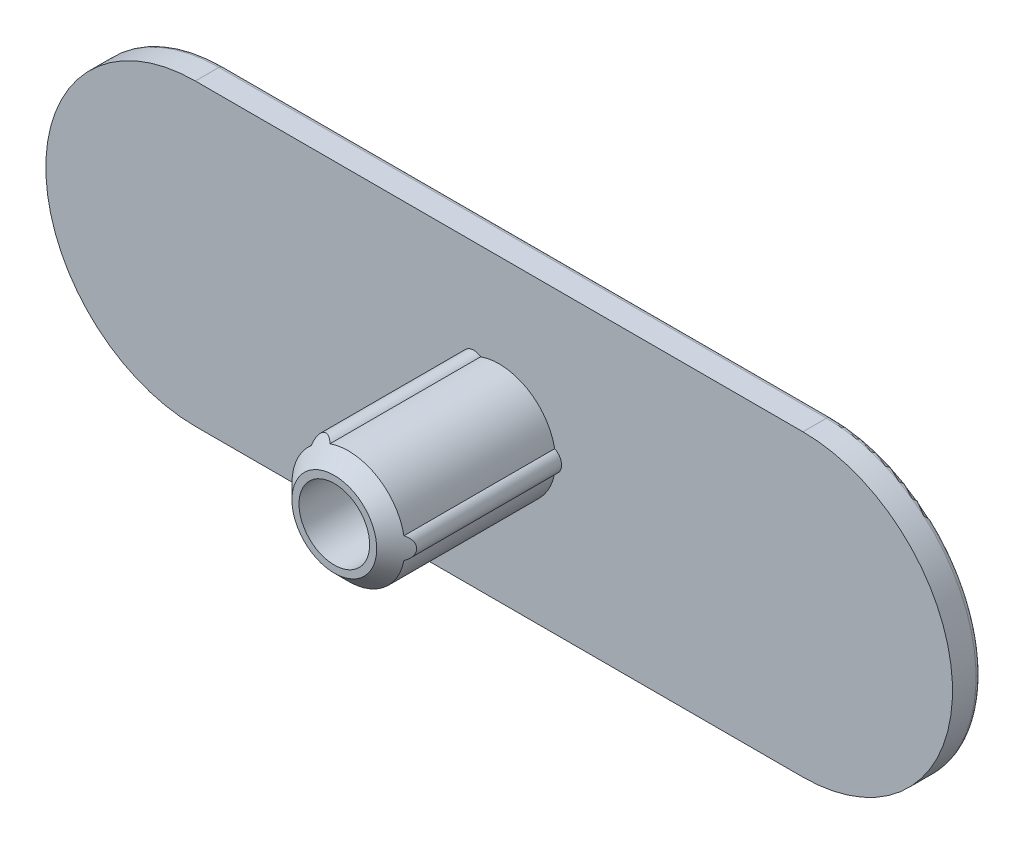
ISO-10303-21;
HEADER;
FILE_DESCRIPTION(('STEP AP214'),'2;1');
FILE_NAME('part.step','',(''),(''),'','','');
FILE_SCHEMA(('AUTOMOTIVE_DESIGN { 1 0 10303 214 1 1 1 1 }'));
ENDSEC;
DATA;
#1=APPLICATION_CONTEXT('core data for automotive mechanical design processes');
#2=APPLICATION_PROTOCOL_DEFINITION('international standard','automotive_design',2000,#1);
#3=PRODUCT_CONTEXT('',#1,'mechanical');
#4=PRODUCT('Part','Part','',(#3));
#5=PRODUCT_RELATED_PRODUCT_CATEGORY('part','',(#4));
#6=PRODUCT_DEFINITION_FORMATION('','',#4);
#7=PRODUCT_DEFINITION_CONTEXT('part definition',#1,'design');
#8=PRODUCT_DEFINITION('design','',#6,#7);
#9=PRODUCT_DEFINITION_SHAPE('','',#8);
#10=(LENGTH_UNIT() NAMED_UNIT(*) SI_UNIT(.MILLI.,.METRE.));
#11=(NAMED_UNIT(*) PLANE_ANGLE_UNIT() SI_UNIT($,.RADIAN.));
#12=(NAMED_UNIT(*) SI_UNIT($,.STERADIAN.) SOLID_ANGLE_UNIT());
#13=UNCERTAINTY_MEASURE_WITH_UNIT(LENGTH_MEASURE(1.E-05),#10,'distance_accuracy_value','');
#14=(GEOMETRIC_REPRESENTATION_CONTEXT(3) GLOBAL_UNCERTAINTY_ASSIGNED_CONTEXT((#13)) GLOBAL_UNIT_ASSIGNED_CONTEXT((#10,
#11,#12)) REPRESENTATION_CONTEXT('',''));
#15=CARTESIAN_POINT('',(0.,0.,0.));
#16=DIRECTION('',(0.,0.,1.));
#17=DIRECTION('',(1.,0.,0.));
#18=AXIS2_PLACEMENT_3D('',#15,#16,#17);
#19=CARTESIAN_POINT('',(0.,0.,1.1));
#20=DIRECTION('',(0.,0.,-1.));
#21=DIRECTION('',(-1.,0.,0.));
#22=AXIS2_PLACEMENT_3D('',#19,#20,#21);
#23=PLANE('',#22);
#24=CARTESIAN_POINT('',(0.,0.,1.1));
#25=DIRECTION('',(0.,0.,-1.));
#26=DIRECTION('',(0.,1.,0.));
#27=AXIS2_PLACEMENT_3D('',#24,#25,#26);
#28=CIRCLE('',#27,1.5);
#29=CARTESIAN_POINT('',(0.,1.5,1.1));
#30=VERTEX_POINT('',#29);
#31=EDGE_CURVE('E19',#30,#30,#28,.F.);
#32=ORIENTED_EDGE('',*,*,#31,.T.);
#33=EDGE_LOOP('',(#32));
#34=FACE_BOUND('',#33,.T.);
#35=ADVANCED_FACE('F16',(#34),#23,.F.);
#36=CARTESIAN_POINT('',(0.,0.,7.6));
#37=DIRECTION('',(0.,0.,-1.));
#38=DIRECTION('',(0.,1.,0.));
#39=AXIS2_PLACEMENT_3D('',#36,#37,#38);
#40=CYLINDRICAL_SURFACE('',#39,1.5);
#41=CARTESIAN_POINT('',(0.,0.,7.6));
#42=DIRECTION('',(0.,0.,-1.));
#43=DIRECTION('',(0.,1.,0.));
#44=AXIS2_PLACEMENT_3D('',#41,#42,#43);
#45=CIRCLE('',#44,1.5);
#46=CARTESIAN_POINT('',(0.,1.5,7.6));
#47=VERTEX_POINT('',#46);
#48=EDGE_CURVE('E113',#47,#47,#45,.T.);
#49=ORIENTED_EDGE('',*,*,#48,.F.);
#50=EDGE_LOOP('',(#49));
#51=FACE_BOUND('',#50,.T.);
#52=ORIENTED_EDGE('',*,*,#31,.F.);
#53=EDGE_LOOP('',(#52));
#54=FACE_BOUND('',#53,.T.);
#55=ADVANCED_FACE('F182',(#51,#54),#40,.F.);
#56=CARTESIAN_POINT('',(0.,0.,7.6));
#57=DIRECTION('',(0.,0.,1.));
#58=DIRECTION('',(1.,0.,0.));
#59=AXIS2_PLACEMENT_3D('',#56,#57,#58);
#60=PLANE('',#59);
#61=ORIENTED_EDGE('',*,*,#48,.T.);
#62=EDGE_LOOP('',(#61));
#63=FACE_BOUND('',#62,.T.);
#64=CARTESIAN_POINT('',(0.,0.,7.60000000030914));
#65=DIRECTION('',(0.,0.,-1.));
#66=DIRECTION('',(0.,1.,0.));
#67=AXIS2_PLACEMENT_3D('',#64,#65,#66);
#68=CIRCLE('',#67,1.80000000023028);
#69=CARTESIAN_POINT('',(0.,1.80000000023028,7.60000000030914));
#70=VERTEX_POINT('',#69);
#71=EDGE_CURVE('E174',#70,#70,#68,.T.);
#72=ORIENTED_EDGE('',*,*,#71,.F.);
#73=EDGE_LOOP('',(#72));
#74=FACE_BOUND('',#73,.T.);
#75=ADVANCED_FACE('F184',(#63,#74),#60,.T.);
#76=CARTESIAN_POINT('',(-1.075,1.86195461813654,0.6));
#77=DIRECTION('',(0.,0.,1.));
#78=DIRECTION('',(1.,0.,0.));
#79=AXIS2_PLACEMENT_3D('',#76,#77,#78);
#80=CYLINDRICAL_SURFACE('',#79,0.5);
#81=CARTESIAN_POINT('',(-1.075,1.86195461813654,0.6));
#82=DIRECTION('',(0.,0.,1.));
#83=DIRECTION('',(1.,0.,0.));
#84=AXIS2_PLACEMENT_3D('',#81,#82,#83);
#85=CIRCLE('',#84,0.5);
#86=CARTESIAN_POINT('',(-0.783798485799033,2.2684047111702,0.6));
#87=VERTEX_POINT('',#86);
#88=CARTESIAN_POINT('',(-1.57259686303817,1.81299175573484,0.6));
#89=VERTEX_POINT('',#88);
#90=EDGE_CURVE('E102',#87,#89,#85,.T.);
#91=ORIENTED_EDGE('',*,*,#90,.T.);
#92=DIRECTION('',(0.,0.,1.));
#93=VECTOR('',#92,1.);
#94=CARTESIAN_POINT('',(-1.57259686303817,1.81299175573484,0.6));
#95=LINE('',#94,#93);
#96=CARTESIAN_POINT('',(-1.57259686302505,1.81299175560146,6.99999999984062));
#97=VERTEX_POINT('',#96);
#98=EDGE_CURVE('E108',#97,#89,#95,.F.);
#99=ORIENTED_EDGE('',*,*,#98,.F.);
#100=CARTESIAN_POINT('',(-0.783798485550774,2.26840471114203,6.99999999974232));
#101=CARTESIAN_POINT('',(-0.810386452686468,2.28747811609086,6.97326995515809));
#102=CARTESIAN_POINT('',(-0.839755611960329,2.30452835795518,6.94735774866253));
#103=CARTESIAN_POINT('',(-0.903591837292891,2.33296381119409,6.89829129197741));
#104=CARTESIAN_POINT('',(-0.938102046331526,2.34429712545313,6.87516370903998));
#105=CARTESIAN_POINT('',(-0.997817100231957,2.35652488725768,6.84100170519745));
#106=CARTESIAN_POINT('',(-1.02178258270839,2.35972475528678,6.82864604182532));
#107=CARTESIAN_POINT('',(-1.07088241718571,2.36253948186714,6.80617958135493));
#108=CARTESIAN_POINT('',(-1.09601279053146,2.3621657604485,6.7960617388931));
#109=CARTESIAN_POINT('',(-1.14711032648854,2.35739810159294,6.7784349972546));
#110=CARTESIAN_POINT('',(-1.17308327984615,2.35296475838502,6.77095266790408));
#111=CARTESIAN_POINT('',(-1.22467991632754,2.3397651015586,6.7592293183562));
#112=CARTESIAN_POINT('',(-1.25030373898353,2.33100057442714,6.75498696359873));
#113=CARTESIAN_POINT('',(-1.29661905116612,2.31076811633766,6.75041023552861));
#114=CARTESIAN_POINT('',(-1.31750297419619,2.29984076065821,6.74961703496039));
#115=CARTESIAN_POINT('',(-1.35746399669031,2.27519107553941,6.75072593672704));
#116=CARTESIAN_POINT('',(-1.37654186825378,2.26146994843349,6.75262688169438));
#117=CARTESIAN_POINT('',(-1.41115113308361,2.23273134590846,6.75879339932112));
#118=CARTESIAN_POINT('',(-1.42683327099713,2.21785853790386,6.76289518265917));
#119=CARTESIAN_POINT('',(-1.45585234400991,2.18661795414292,6.77314342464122));
#120=CARTESIAN_POINT('',(-1.46918907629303,2.17025004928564,6.77929005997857));
#121=CARTESIAN_POINT('',(-1.4942639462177,2.13529173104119,6.79388089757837));
#122=CARTESIAN_POINT('',(-1.50581861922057,2.11662611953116,6.8024583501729));
#123=CARTESIAN_POINT('',(-1.5261152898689,2.07865619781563,6.82134449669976));
#124=CARTESIAN_POINT('',(-1.53485502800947,2.0593513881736,6.83165457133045));
#125=CARTESIAN_POINT('',(-1.55297453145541,2.01177935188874,6.85867480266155));
#126=CARTESIAN_POINT('',(-1.56086921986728,1.98339209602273,6.87617589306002));
#127=CARTESIAN_POINT('',(-1.57156234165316,1.92714038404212,6.91339580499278));
#128=CARTESIAN_POINT('',(-1.57435438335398,1.89927662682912,6.93311737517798));
#129=CARTESIAN_POINT('',(-1.57529897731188,1.85197460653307,6.96870196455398));
#130=CARTESIAN_POINT('',(-1.57449063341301,1.83227189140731,6.9841905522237));
#131=CARTESIAN_POINT('',(-1.57259686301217,1.81299175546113,6.99999999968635));
#132=B_SPLINE_CURVE_WITH_KNOTS('',3,(#100,#101,#102,#103,#104,#105,#106,#107,#108,#109,#110,
#111,#112,#113,#114,#115,#116,#117,#118,#119,#120,#121,#122,#123,#124,#125,#126,#127,#128,#129,
#130,#131),.UNSPECIFIED.,.F.,.F.,(4,2,2,2,2,2,2,2,2,2,2,2,2,2,2,4),(0.,0.127138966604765,
0.255412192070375,0.336558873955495,0.41744632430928,0.499127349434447,0.580774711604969,
0.651145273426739,0.721485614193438,0.787198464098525,0.852916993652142,0.923352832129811,
0.993845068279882,1.09609091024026,1.19846473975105,1.27352419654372),.UNSPECIFIED.);
#133=CARTESIAN_POINT('',(-0.783798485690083,2.26840471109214,6.99999999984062));
#134=VERTEX_POINT('',#133);
#135=EDGE_CURVE('E112',#134,#97,#132,.T.);
#136=ORIENTED_EDGE('',*,*,#135,.F.);
#137=DIRECTION('',(0.,0.,1.));
#138=VECTOR('',#137,1.);
#139=CARTESIAN_POINT('',(-0.783798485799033,2.2684047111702,0.6));
#140=LINE('',#139,#138);
#141=EDGE_CURVE('E110',#87,#134,#140,.T.);
#142=ORIENTED_EDGE('',*,*,#141,.F.);
#143=EDGE_LOOP('',(#91,#99,#136,#142));
#144=FACE_BOUND('',#143,.T.);
#145=ADVANCED_FACE('F107',(#144),#80,.T.);
#146=CARTESIAN_POINT('',(0.,0.,6.74489409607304));
#147=DIRECTION('',(0.,0.,-1.));
#148=DIRECTION('',(0.,1.,0.));
#149=AXIS2_PLACEMENT_3D('',#146,#147,#148);
#150=CONICAL_SURFACE('',#149,2.65510590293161,0.785398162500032);
#151=ORIENTED_EDGE('',*,*,#71,.T.);
#152=EDGE_LOOP('',(#151));
#153=FACE_BOUND('',#152,.T.);
#154=CARTESIAN_POINT('',(0.,0.,7.));
#155=DIRECTION('',(0.,0.,1.));
#156=DIRECTION('',(1.,0.,0.));
#157=AXIS2_PLACEMENT_3D('',#154,#155,#156);
#158=CIRCLE('',#157,2.4);
#159=CARTESIAN_POINT('',(2.35639534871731,0.455412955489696,6.99999999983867));
#160=VERTEX_POINT('',#159);
#161=EDGE_CURVE('E327',#134,#160,#158,.F.);
#162=ORIENTED_EDGE('',*,*,#161,.F.);
#163=ORIENTED_EDGE('',*,*,#135,.T.);
#164=CARTESIAN_POINT('',(0.,0.,7.));
#165=DIRECTION('',(0.,0.,1.));
#166=DIRECTION('',(1.,0.,0.));
#167=AXIS2_PLACEMENT_3D('',#164,#165,#166);
#168=CIRCLE('',#167,2.4);
#169=CARTESIAN_POINT('',(-1.57259686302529,-1.81299175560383,6.99999999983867));
#170=VERTEX_POINT('',#169);
#171=EDGE_CURVE('E122',#170,#97,#168,.F.);
#172=ORIENTED_EDGE('',*,*,#171,.F.);
#173=CARTESIAN_POINT('',(-0.78379848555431,-2.26840471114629,6.99999999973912));
#174=CARTESIAN_POINT('',(-0.810386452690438,-2.28747811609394,6.97326995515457));
#175=CARTESIAN_POINT('',(-0.839755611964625,-2.30452835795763,6.94735774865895));
#176=CARTESIAN_POINT('',(-0.903591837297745,-2.33296381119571,6.89829129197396));
#177=CARTESIAN_POINT('',(-0.938102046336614,-2.34429712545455,6.87516370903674));
#178=CARTESIAN_POINT('',(-0.997817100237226,-2.35652488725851,6.84100170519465));
#179=CARTESIAN_POINT('',(-1.0217825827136,-2.35972475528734,6.82864604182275));
#180=CARTESIAN_POINT('',(-1.07088241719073,-2.36253948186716,6.80617958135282));
#181=CARTESIAN_POINT('',(-1.09601279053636,-2.36216576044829,6.79606173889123));
#182=CARTESIAN_POINT('',(-1.14711032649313,-2.35739810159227,6.77843499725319));
#183=CARTESIAN_POINT('',(-1.17308327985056,-2.35296475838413,6.7709526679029));
#184=CARTESIAN_POINT('',(-1.22467991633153,-2.33976510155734,6.75922931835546));
#185=CARTESIAN_POINT('',(-1.25030373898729,-2.33100057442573,6.7549869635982));
#186=CARTESIAN_POINT('',(-1.29661905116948,-2.310768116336,6.75041023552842));
#187=CARTESIAN_POINT('',(-1.31750297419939,-2.29984076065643,6.74961703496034));
#188=CARTESIAN_POINT('',(-1.35746399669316,-2.27519107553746,6.75072593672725));
#189=CARTESIAN_POINT('',(-1.37654186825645,-2.26146994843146,6.75262688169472));
#190=CARTESIAN_POINT('',(-1.41115113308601,-2.2327313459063,6.75879339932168));
#191=CARTESIAN_POINT('',(-1.42683327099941,-2.2178585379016,6.76289518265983));
#192=CARTESIAN_POINT('',(-1.45585234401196,-2.1866179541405,6.77314342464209));
#193=CARTESIAN_POINT('',(-1.46918907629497,-2.17025004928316,6.77929005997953));
#194=CARTESIAN_POINT('',(-1.49426394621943,-2.13529173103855,6.79388089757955));
#195=CARTESIAN_POINT('',(-1.50581861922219,-2.11662611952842,6.80245835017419));
#196=CARTESIAN_POINT('',(-1.5261152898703,-2.07865619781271,6.82134449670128));
#197=CARTESIAN_POINT('',(-1.53485502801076,-2.05935138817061,6.83165457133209));
#198=CARTESIAN_POINT('',(-1.55297453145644,-2.01177935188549,6.85867480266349));
#199=CARTESIAN_POINT('',(-1.56086921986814,-1.98339209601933,6.87617589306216));
#200=CARTESIAN_POINT('',(-1.57156234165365,-1.92714038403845,6.91339580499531));
#201=CARTESIAN_POINT('',(-1.57435438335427,-1.89927662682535,6.9331173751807));
#202=CARTESIAN_POINT('',(-1.57529897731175,-1.85197460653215,6.96870196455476));
#203=CARTESIAN_POINT('',(-1.57449063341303,-1.83227189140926,6.98419055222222));
#204=CARTESIAN_POINT('',(-1.57259686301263,-1.8129917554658,6.99999999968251));
#205=B_SPLINE_CURVE_WITH_KNOTS('',3,(#173,#174,#175,#176,#177,#178,#179,#180,#181,#182,#183,
#184,#185,#186,#187,#188,#189,#190,#191,#192,#193,#194,#195,#196,#197,#198,#199,#200,#201,#202,
#203,#204),.UNSPECIFIED.,.F.,.F.,(4,2,2,2,2,2,2,2,2,2,2,2,2,2,2,4),(0.,0.127138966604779,
0.255412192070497,0.336558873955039,0.417446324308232,0.499127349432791,0.580774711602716,
0.651145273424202,0.721485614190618,0.787198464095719,0.85291699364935,0.923352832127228,
0.993845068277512,1.09609091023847,1.1984647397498,1.27352419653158),.UNSPECIFIED.);
#206=CARTESIAN_POINT('',(-0.78379848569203,-2.26840471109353,6.99999999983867));
#207=VERTEX_POINT('',#206);
#208=EDGE_CURVE('E165',#207,#170,#205,.T.);
#209=ORIENTED_EDGE('',*,*,#208,.F.);
#210=CARTESIAN_POINT('',(0.,0.,7.));
#211=DIRECTION('',(0.,0.,1.));
#212=DIRECTION('',(1.,0.,0.));
#213=AXIS2_PLACEMENT_3D('',#210,#211,#212);
#214=CIRCLE('',#213,2.4);
#215=CARTESIAN_POINT('',(2.35639534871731,-0.455412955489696,6.99999999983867));
#216=VERTEX_POINT('',#215);
#217=EDGE_CURVE('E322',#216,#207,#214,.F.);
#218=ORIENTED_EDGE('',*,*,#217,.F.);
#219=CARTESIAN_POINT('',(2.35639534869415,0.455412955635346,6.99999999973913));
#220=CARTESIAN_POINT('',(2.38620738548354,0.441923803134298,6.97326995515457));
#221=CARTESIAN_POINT('',(2.41565790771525,0.425014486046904,6.94735774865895));
#222=CARTESIAN_POINT('',(2.47220184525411,0.383948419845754,6.89829129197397));
#223=CARTESIAN_POINT('',(2.49927188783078,0.359728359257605,6.87516370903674));
#224=CARTESIAN_POINT('',(2.53971896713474,0.314127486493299,6.84100170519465));
#225=CARTESIAN_POINT('',(2.55447287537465,0.294972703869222,6.82864604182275));
#226=CARTESIAN_POINT('',(2.58146041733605,0.253858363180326,6.80617958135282));
#227=CARTESIAN_POINT('',(2.59370195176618,0.231907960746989,6.79606173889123));
#228=CARTESIAN_POINT('',(2.61512180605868,0.185272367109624,6.7784349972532));
#229=CARTESIAN_POINT('',(2.62426889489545,0.160562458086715,6.77095266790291));
#230=CARTESIAN_POINT('',(2.6386359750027,0.109278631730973,6.75922931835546));
#231=CARTESIAN_POINT('',(2.64385758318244,0.08270548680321,6.7549869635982));
#232=CARTESIAN_POINT('',(2.64949341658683,0.0324790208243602,6.75041023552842));
#233=CARTESIAN_POINT('',(2.65047201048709,0.00892933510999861,6.74961703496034));
#234=CARTESIAN_POINT('',(2.64910526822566,-0.0380027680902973,6.75072593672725));
#235=CARTESIAN_POINT('',(2.64676135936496,-0.0613852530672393,6.75262688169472));
#236=CARTESIAN_POINT('',(2.63917763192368,-0.105727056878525,6.75879339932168));
#237=CARTESIAN_POINT('',(2.63413847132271,-0.126744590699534,6.76289518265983));
#238=CARTESIAN_POINT('',(2.62159286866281,-0.167496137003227,6.77314342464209));
#239=CARTESIAN_POINT('',(2.61408621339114,-0.187230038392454,6.77929005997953));
#240=CARTESIAN_POINT('',(2.59634885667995,-0.22642467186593,6.79388089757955));
#241=CARTESIAN_POINT('',(2.58596129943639,-0.24576411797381,6.80245835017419));
#242=CARTESIAN_POINT('',(2.56322671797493,-0.282326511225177,6.82134449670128));
#243=CARTESIAN_POINT('',(2.55087813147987,-0.299547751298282,6.83165457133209));
#244=CARTESIAN_POINT('',(2.51873929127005,-0.339025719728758,6.85867480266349));
#245=CARTESIAN_POINT('',(2.49810255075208,-0.360056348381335,6.87617589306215));
#246=CARTESIAN_POINT('',(2.45473370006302,-0.39744271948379,6.91339580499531));
#247=CARTESIAN_POINT('',(2.4319989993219,-0.413792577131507,6.9331173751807));
#248=CARTESIAN_POINT('',(2.39150654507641,-0.438261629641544,6.96870196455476));
#249=CARTESIAN_POINT('',(2.37403932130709,-0.447412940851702,6.98419055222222));
#250=CARTESIAN_POINT('',(2.35639534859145,-0.455412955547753,6.99999999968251));
#251=B_SPLINE_CURVE_WITH_KNOTS('',3,(#219,#220,#221,#222,#223,#224,#225,#226,#227,#228,#229,
#230,#231,#232,#233,#234,#235,#236,#237,#238,#239,#240,#241,#242,#243,#244,#245,#246,#247,#248,
#249,#250),.UNSPECIFIED.,.F.,.F.,(4,2,2,2,2,2,2,2,2,2,2,2,2,2,2,4),(0.,0.127138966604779,
0.255412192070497,0.336558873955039,0.417446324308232,0.499127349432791,0.580774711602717,
0.651145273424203,0.721485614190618,0.78719846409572,0.85291699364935,0.923352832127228,
0.993845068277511,1.09609091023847,1.1984647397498,1.27352419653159),.UNSPECIFIED.);
#252=EDGE_CURVE('E142',#160,#216,#251,.T.);
#253=ORIENTED_EDGE('',*,*,#252,.F.);
#254=EDGE_LOOP('',(#162,#163,#172,#209,#218,#253));
#255=FACE_BOUND('',#254,.T.);
#256=ADVANCED_FACE('F154',(#153,#255),#150,.T.);
#257=CARTESIAN_POINT('',(-1.075,-1.86195461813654,0.6));
#258=DIRECTION('',(0.,0.,1.));
#259=DIRECTION('',(1.,0.,0.));
#260=AXIS2_PLACEMENT_3D('',#257,#258,#259);
#261=CYLINDRICAL_SURFACE('',#260,0.5);
#262=CARTESIAN_POINT('',(-1.075,-1.86195461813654,0.6));
#263=DIRECTION('',(0.,0.,1.));
#264=DIRECTION('',(1.,0.,0.));
#265=AXIS2_PLACEMENT_3D('',#262,#263,#264);
#266=CIRCLE('',#265,0.5);
#267=CARTESIAN_POINT('',(-1.57259686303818,-1.81299175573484,0.6));
#268=VERTEX_POINT('',#267);
#269=CARTESIAN_POINT('',(-0.783798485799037,-2.2684047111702,0.6));
#270=VERTEX_POINT('',#269);
#271=EDGE_CURVE('E128',#268,#270,#266,.T.);
#272=ORIENTED_EDGE('',*,*,#271,.T.);
#273=DIRECTION('',(0.,0.,1.));
#274=VECTOR('',#273,1.);
#275=CARTESIAN_POINT('',(-0.783798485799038,-2.2684047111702,0.6));
#276=LINE('',#275,#274);
#277=EDGE_CURVE('E136',#207,#270,#276,.F.);
#278=ORIENTED_EDGE('',*,*,#277,.F.);
#279=ORIENTED_EDGE('',*,*,#208,.T.);
#280=DIRECTION('',(0.,0.,1.));
#281=VECTOR('',#280,1.);
#282=CARTESIAN_POINT('',(-1.57259686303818,-1.81299175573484,0.6));
#283=LINE('',#282,#281);
#284=EDGE_CURVE('E123',#268,#170,#283,.T.);
#285=ORIENTED_EDGE('',*,*,#284,.F.);
#286=EDGE_LOOP('',(#272,#278,#279,#285));
#287=FACE_BOUND('',#286,.T.);
#288=ADVANCED_FACE('F158',(#287),#261,.T.);
#289=CARTESIAN_POINT('',(2.15,0.,0.6));
#290=DIRECTION('',(0.,0.,1.));
#291=DIRECTION('',(1.,0.,0.));
#292=AXIS2_PLACEMENT_3D('',#289,#290,#291);
#293=CYLINDRICAL_SURFACE('',#292,0.5);
#294=CARTESIAN_POINT('',(2.15,0.,0.6));
#295=DIRECTION('',(0.,0.,1.));
#296=DIRECTION('',(1.,0.,0.));
#297=AXIS2_PLACEMENT_3D('',#294,#295,#296);
#298=CIRCLE('',#297,0.5);
#299=CARTESIAN_POINT('',(2.35639534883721,-0.455412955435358,0.6));
#300=VERTEX_POINT('',#299);
#301=CARTESIAN_POINT('',(2.35639534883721,0.455412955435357,0.6));
#302=VERTEX_POINT('',#301);
#303=EDGE_CURVE('E140',#300,#302,#298,.T.);
#304=ORIENTED_EDGE('',*,*,#303,.T.);
#305=DIRECTION('',(0.,0.,1.));
#306=VECTOR('',#305,1.);
#307=CARTESIAN_POINT('',(2.35639534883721,0.455412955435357,0.6));
#308=LINE('',#307,#306);
#309=EDGE_CURVE('E324',#160,#302,#308,.F.);
#310=ORIENTED_EDGE('',*,*,#309,.F.);
#311=ORIENTED_EDGE('',*,*,#252,.T.);
#312=DIRECTION('',(0.,0.,1.));
#313=VECTOR('',#312,1.);
#314=CARTESIAN_POINT('',(2.35639534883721,-0.455412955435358,0.6));
#315=LINE('',#314,#313);
#316=EDGE_CURVE('E131',#300,#216,#315,.T.);
#317=ORIENTED_EDGE('',*,*,#316,.F.);
#318=EDGE_LOOP('',(#304,#310,#311,#317));
#319=FACE_BOUND('',#318,.T.);
#320=ADVANCED_FACE('F150',(#319),#293,.T.);
#321=CARTESIAN_POINT('',(0.,0.,0.6));
#322=DIRECTION('',(0.,0.,1.));
#323=DIRECTION('',(1.,0.,0.));
#324=AXIS2_PLACEMENT_3D('',#321,#322,#323);
#325=CYLINDRICAL_SURFACE('',#324,2.4);
#326=CARTESIAN_POINT('',(0.,0.,0.6));
#327=DIRECTION('',(0.,0.,1.));
#328=DIRECTION('',(1.,0.,0.));
#329=AXIS2_PLACEMENT_3D('',#326,#327,#328);
#330=CIRCLE('',#329,2.4);
#331=EDGE_CURVE('E120',#268,#89,#330,.F.);
#332=ORIENTED_EDGE('',*,*,#331,.F.);
#333=ORIENTED_EDGE('',*,*,#284,.T.);
#334=ORIENTED_EDGE('',*,*,#171,.T.);
#335=ORIENTED_EDGE('',*,*,#98,.T.);
#336=EDGE_LOOP('',(#332,#333,#334,#335));
#337=FACE_BOUND('',#336,.T.);
#338=ADVANCED_FACE('F118',(#337),#325,.T.);
#339=CARTESIAN_POINT('',(0.,0.,0.6));
#340=DIRECTION('',(0.,0.,1.));
#341=DIRECTION('',(1.,0.,0.));
#342=AXIS2_PLACEMENT_3D('',#339,#340,#341);
#343=CYLINDRICAL_SURFACE('',#342,2.4);
#344=CARTESIAN_POINT('',(0.,0.,0.6));
#345=DIRECTION('',(0.,0.,1.));
#346=DIRECTION('',(1.,0.,0.));
#347=AXIS2_PLACEMENT_3D('',#344,#345,#346);
#348=CIRCLE('',#347,2.4);
#349=EDGE_CURVE('E130',#87,#302,#348,.F.);
#350=ORIENTED_EDGE('',*,*,#349,.F.);
#351=ORIENTED_EDGE('',*,*,#141,.T.);
#352=ORIENTED_EDGE('',*,*,#161,.T.);
#353=ORIENTED_EDGE('',*,*,#309,.T.);
#354=EDGE_LOOP('',(#350,#351,#352,#353));
#355=FACE_BOUND('',#354,.T.);
#356=ADVANCED_FACE('F350',(#355),#343,.T.);
#357=CARTESIAN_POINT('',(0.,0.,0.6));
#358=DIRECTION('',(0.,0.,1.));
#359=DIRECTION('',(1.,0.,0.));
#360=AXIS2_PLACEMENT_3D('',#357,#358,#359);
#361=CYLINDRICAL_SURFACE('',#360,2.4);
#362=CARTESIAN_POINT('',(0.,0.,0.6));
#363=DIRECTION('',(0.,0.,1.));
#364=DIRECTION('',(1.,0.,0.));
#365=AXIS2_PLACEMENT_3D('',#362,#363,#364);
#366=CIRCLE('',#365,2.4);
#367=EDGE_CURVE('E133',#300,#270,#366,.F.);
#368=ORIENTED_EDGE('',*,*,#367,.F.);
#369=ORIENTED_EDGE('',*,*,#316,.T.);
#370=ORIENTED_EDGE('',*,*,#217,.T.);
#371=ORIENTED_EDGE('',*,*,#277,.T.);
#372=EDGE_LOOP('',(#368,#369,#370,#371));
#373=FACE_BOUND('',#372,.T.);
#374=ADVANCED_FACE('F337',(#373),#361,.T.);
#375=CARTESIAN_POINT('',(0.,0.,0.6));
#376=DIRECTION('',(0.,0.,1.));
#377=DIRECTION('',(1.,0.,0.));
#378=AXIS2_PLACEMENT_3D('',#375,#376,#377);
#379=PLANE('',#378);
#380=ORIENTED_EDGE('',*,*,#367,.T.);
#381=ORIENTED_EDGE('',*,*,#271,.F.);
#382=ORIENTED_EDGE('',*,*,#331,.T.);
#383=ORIENTED_EDGE('',*,*,#90,.F.);
#384=ORIENTED_EDGE('',*,*,#349,.T.);
#385=ORIENTED_EDGE('',*,*,#303,.F.);
#386=EDGE_LOOP('',(#380,#381,#382,#383,#384,#385));
#387=FACE_BOUND('',#386,.T.);
#388=CARTESIAN_POINT('',(-12.9,0.,0.6));
#389=DIRECTION('',(0.,0.,1.));
#390=DIRECTION('',(1.,0.,0.));
#391=AXIS2_PLACEMENT_3D('',#388,#389,#390);
#392=CIRCLE('',#391,6.35);
#393=CARTESIAN_POINT('',(-12.9,-6.35,0.6));
#394=VERTEX_POINT('',#393);
#395=CARTESIAN_POINT('',(-12.9,6.35,0.6));
#396=VERTEX_POINT('',#395);
#397=EDGE_CURVE('E306',#394,#396,#392,.F.);
#398=ORIENTED_EDGE('',*,*,#397,.F.);
#399=DIRECTION('',(1.,0.,0.));
#400=VECTOR('',#399,1.);
#401=CARTESIAN_POINT('',(12.9,-6.35,0.6));
#402=LINE('',#401,#400);
#403=CARTESIAN_POINT('',(12.9,-6.35,0.6));
#404=VERTEX_POINT('',#403);
#405=EDGE_CURVE('E291',#404,#394,#402,.F.);
#406=ORIENTED_EDGE('',*,*,#405,.F.);
#407=CARTESIAN_POINT('',(12.9,0.,0.6));
#408=DIRECTION('',(0.,0.,1.));
#409=DIRECTION('',(1.,0.,0.));
#410=AXIS2_PLACEMENT_3D('',#407,#408,#409);
#411=CIRCLE('',#410,6.35);
#412=CARTESIAN_POINT('',(12.9,6.35,0.6));
#413=VERTEX_POINT('',#412);
#414=EDGE_CURVE('E320',#413,#404,#411,.F.);
#415=ORIENTED_EDGE('',*,*,#414,.F.);
#416=DIRECTION('',(1.,0.,0.));
#417=VECTOR('',#416,1.);
#418=CARTESIAN_POINT('',(-12.9,6.35,0.6));
#419=LINE('',#418,#417);
#420=EDGE_CURVE('E315',#396,#413,#419,.T.);
#421=ORIENTED_EDGE('',*,*,#420,.F.);
#422=EDGE_LOOP('',(#398,#406,#415,#421));
#423=FACE_BOUND('',#422,.T.);
#424=ADVANCED_FACE('F126',(#387,#423),#379,.T.);
#425=CARTESIAN_POINT('',(12.9,0.,0.));
#426=DIRECTION('',(0.,0.,1.));
#427=DIRECTION('',(1.,0.,0.));
#428=AXIS2_PLACEMENT_3D('',#425,#426,#427);
#429=CYLINDRICAL_SURFACE('',#428,6.35);
#430=ORIENTED_EDGE('',*,*,#414,.T.);
#431=DIRECTION('',(0.,0.,-1.));
#432=VECTOR('',#431,1.);
#433=CARTESIAN_POINT('',(12.9,-6.35,0.));
#434=LINE('',#433,#432);
#435=CARTESIAN_POINT('',(12.9,-6.35,-0.4));
#436=VERTEX_POINT('',#435);
#437=EDGE_CURVE('E288',#436,#404,#434,.F.);
#438=ORIENTED_EDGE('',*,*,#437,.F.);
#439=CARTESIAN_POINT('',(12.9,0.,-0.4));
#440=DIRECTION('',(0.,0.,1.));
#441=DIRECTION('',(1.,0.,0.));
#442=AXIS2_PLACEMENT_3D('',#439,#440,#441);
#443=CIRCLE('',#442,6.35);
#444=CARTESIAN_POINT('',(12.9,6.35,-0.4));
#445=VERTEX_POINT('',#444);
#446=EDGE_CURVE('E278',#445,#436,#443,.F.);
#447=ORIENTED_EDGE('',*,*,#446,.F.);
#448=DIRECTION('',(0.,0.,1.));
#449=VECTOR('',#448,1.);
#450=CARTESIAN_POINT('',(12.9,6.35,0.));
#451=LINE('',#450,#449);
#452=EDGE_CURVE('E313',#413,#445,#451,.F.);
#453=ORIENTED_EDGE('',*,*,#452,.F.);
#454=EDGE_LOOP('',(#430,#438,#447,#453));
#455=FACE_BOUND('',#454,.T.);
#456=ADVANCED_FACE('F408',(#455),#429,.T.);
#457=CARTESIAN_POINT('',(-12.9,6.35,0.));
#458=DIRECTION('',(0.,1.,0.));
#459=DIRECTION('',(0.,0.,1.));
#460=AXIS2_PLACEMENT_3D('',#457,#458,#459);
#461=PLANE('',#460);
#462=ORIENTED_EDGE('',*,*,#420,.T.);
#463=ORIENTED_EDGE('',*,*,#452,.T.);
#464=DIRECTION('',(-1.,0.,0.));
#465=VECTOR('',#464,1.);
#466=CARTESIAN_POINT('',(-6.45,6.35,-0.4));
#467=LINE('',#466,#465);
#468=CARTESIAN_POINT('',(-12.9,6.35,-0.4));
#469=VERTEX_POINT('',#468);
#470=EDGE_CURVE('E261',#469,#445,#467,.F.);
#471=ORIENTED_EDGE('',*,*,#470,.F.);
#472=DIRECTION('',(0.,0.,1.));
#473=VECTOR('',#472,1.);
#474=CARTESIAN_POINT('',(-12.9,6.35,0.));
#475=LINE('',#474,#473);
#476=EDGE_CURVE('E292',#396,#469,#475,.F.);
#477=ORIENTED_EDGE('',*,*,#476,.F.);
#478=EDGE_LOOP('',(#462,#463,#471,#477));
#479=FACE_BOUND('',#478,.T.);
#480=ADVANCED_FACE('F415',(#479),#461,.T.);
#481=CARTESIAN_POINT('',(-12.9,0.,0.));
#482=DIRECTION('',(0.,0.,1.));
#483=DIRECTION('',(1.,0.,0.));
#484=AXIS2_PLACEMENT_3D('',#481,#482,#483);
#485=CYLINDRICAL_SURFACE('',#484,6.35);
#486=ORIENTED_EDGE('',*,*,#397,.T.);
#487=ORIENTED_EDGE('',*,*,#476,.T.);
#488=CARTESIAN_POINT('',(-12.9,0.,-0.4));
#489=DIRECTION('',(0.,0.,1.));
#490=DIRECTION('',(1.,0.,0.));
#491=AXIS2_PLACEMENT_3D('',#488,#489,#490);
#492=CIRCLE('',#491,6.35);
#493=CARTESIAN_POINT('',(-12.9,-6.35,-0.4));
#494=VERTEX_POINT('',#493);
#495=EDGE_CURVE('E229',#494,#469,#492,.F.);
#496=ORIENTED_EDGE('',*,*,#495,.F.);
#497=DIRECTION('',(0.,0.,-1.));
#498=VECTOR('',#497,1.);
#499=CARTESIAN_POINT('',(-12.9,-6.35,0.));
#500=LINE('',#499,#498);
#501=EDGE_CURVE('E285',#394,#494,#500,.T.);
#502=ORIENTED_EDGE('',*,*,#501,.F.);
#503=EDGE_LOOP('',(#486,#487,#496,#502));
#504=FACE_BOUND('',#503,.T.);
#505=ADVANCED_FACE('F423',(#504),#485,.T.);
#506=CARTESIAN_POINT('',(12.9,-6.35,0.));
#507=DIRECTION('',(0.,-1.,0.));
#508=DIRECTION('',(0.,0.,-1.));
#509=AXIS2_PLACEMENT_3D('',#506,#507,#508);
#510=PLANE('',#509);
#511=ORIENTED_EDGE('',*,*,#405,.T.);
#512=ORIENTED_EDGE('',*,*,#501,.T.);
#513=DIRECTION('',(1.,0.,0.));
#514=VECTOR('',#513,1.);
#515=CARTESIAN_POINT('',(6.45,-6.35,-0.4));
#516=LINE('',#515,#514);
#517=EDGE_CURVE('E234',#436,#494,#516,.F.);
#518=ORIENTED_EDGE('',*,*,#517,.F.);
#519=ORIENTED_EDGE('',*,*,#437,.T.);
#520=EDGE_LOOP('',(#511,#512,#518,#519));
#521=FACE_BOUND('',#520,.T.);
#522=ADVANCED_FACE('F272',(#521),#510,.T.);
#523=CARTESIAN_POINT('',(12.9,0.,-0.4));
#524=DIRECTION('',(0.,0.,1.));
#525=DIRECTION('',(1.,0.,0.));
#526=AXIS2_PLACEMENT_3D('',#523,#524,#525);
#527=TOROIDAL_SURFACE('',#526,6.15,0.2);
#528=CARTESIAN_POINT('',(12.9,-6.15,-0.4));
#529=DIRECTION('',(1.,0.,0.));
#530=DIRECTION('',(0.,0.,-1.));
#531=AXIS2_PLACEMENT_3D('',#528,#529,#530);
#532=CIRCLE('',#531,0.2);
#533=CARTESIAN_POINT('',(12.9,-6.15,-0.6));
#534=VERTEX_POINT('',#533);
#535=EDGE_CURVE('E228',#534,#436,#532,.F.);
#536=ORIENTED_EDGE('',*,*,#535,.F.);
#537=CARTESIAN_POINT('',(12.9,0.,-0.6));
#538=DIRECTION('',(0.,0.,1.));
#539=DIRECTION('',(0.,-1.,0.));
#540=AXIS2_PLACEMENT_3D('',#537,#538,#539);
#541=CIRCLE('',#540,6.15);
#542=CARTESIAN_POINT('',(12.9,6.15,-0.6));
#543=VERTEX_POINT('',#542);
#544=EDGE_CURVE('E224',#534,#543,#541,.T.);
#545=ORIENTED_EDGE('',*,*,#544,.T.);
#546=CARTESIAN_POINT('',(12.9,6.15,-0.4));
#547=DIRECTION('',(-1.,0.,0.));
#548=DIRECTION('',(0.,0.,1.));
#549=AXIS2_PLACEMENT_3D('',#546,#547,#548);
#550=CIRCLE('',#549,0.2);
#551=EDGE_CURVE('E257',#445,#543,#550,.T.);
#552=ORIENTED_EDGE('',*,*,#551,.F.);
#553=ORIENTED_EDGE('',*,*,#446,.T.);
#554=EDGE_LOOP('',(#536,#545,#552,#553));
#555=FACE_BOUND('',#554,.T.);
#556=ADVANCED_FACE('F268',(#555),#527,.T.);
#557=CARTESIAN_POINT('',(-6.45,6.15,-0.4));
#558=DIRECTION('',(-1.,0.,0.));
#559=DIRECTION('',(0.,0.,1.));
#560=AXIS2_PLACEMENT_3D('',#557,#558,#559);
#561=CYLINDRICAL_SURFACE('',#560,0.2);
#562=ORIENTED_EDGE('',*,*,#551,.T.);
#563=DIRECTION('',(1.,0.,0.));
#564=VECTOR('',#563,1.);
#565=CARTESIAN_POINT('',(0.,6.15,-0.6));
#566=LINE('',#565,#564);
#567=CARTESIAN_POINT('',(-12.9,6.15,-0.6));
#568=VERTEX_POINT('',#567);
#569=EDGE_CURVE('E221',#543,#568,#566,.F.);
#570=ORIENTED_EDGE('',*,*,#569,.T.);
#571=CARTESIAN_POINT('',(-12.9,6.15,-0.4));
#572=DIRECTION('',(-1.,0.,0.));
#573=DIRECTION('',(0.,1.,0.));
#574=AXIS2_PLACEMENT_3D('',#571,#572,#573);
#575=CIRCLE('',#574,0.2);
#576=EDGE_CURVE('E250',#469,#568,#575,.T.);
#577=ORIENTED_EDGE('',*,*,#576,.F.);
#578=ORIENTED_EDGE('',*,*,#470,.T.);
#579=EDGE_LOOP('',(#562,#570,#577,#578));
#580=FACE_BOUND('',#579,.T.);
#581=ADVANCED_FACE('F244',(#580),#561,.T.);
#582=CARTESIAN_POINT('',(-12.9,0.,-0.4));
#583=DIRECTION('',(0.,0.,1.));
#584=DIRECTION('',(1.,0.,0.));
#585=AXIS2_PLACEMENT_3D('',#582,#583,#584);
#586=TOROIDAL_SURFACE('',#585,6.15,0.2);
#587=CARTESIAN_POINT('',(-12.9,-6.15,-0.4));
#588=DIRECTION('',(1.,0.,0.));
#589=DIRECTION('',(0.,0.,-1.));
#590=AXIS2_PLACEMENT_3D('',#587,#588,#589);
#591=CIRCLE('',#590,0.2);
#592=CARTESIAN_POINT('',(-12.9,-6.15,-0.6));
#593=VERTEX_POINT('',#592);
#594=EDGE_CURVE('E33',#494,#593,#591,.T.);
#595=ORIENTED_EDGE('',*,*,#594,.F.);
#596=ORIENTED_EDGE('',*,*,#495,.T.);
#597=ORIENTED_EDGE('',*,*,#576,.T.);
#598=CARTESIAN_POINT('',(-12.9,0.,-0.6));
#599=DIRECTION('',(0.,0.,1.));
#600=DIRECTION('',(0.,1.,0.));
#601=AXIS2_PLACEMENT_3D('',#598,#599,#600);
#602=CIRCLE('',#601,6.15);
#603=EDGE_CURVE('E25',#568,#593,#602,.T.);
#604=ORIENTED_EDGE('',*,*,#603,.T.);
#605=EDGE_LOOP('',(#595,#596,#597,#604));
#606=FACE_BOUND('',#605,.T.);
#607=ADVANCED_FACE('F199',(#606),#586,.T.);
#608=CARTESIAN_POINT('',(6.45,-6.15,-0.4));
#609=DIRECTION('',(1.,0.,0.));
#610=DIRECTION('',(0.,0.,-1.));
#611=AXIS2_PLACEMENT_3D('',#608,#609,#610);
#612=CYLINDRICAL_SURFACE('',#611,0.2);
#613=ORIENTED_EDGE('',*,*,#535,.T.);
#614=ORIENTED_EDGE('',*,*,#517,.T.);
#615=ORIENTED_EDGE('',*,*,#594,.T.);
#616=DIRECTION('',(1.,0.,0.));
#617=VECTOR('',#616,1.);
#618=CARTESIAN_POINT('',(0.,-6.15,-0.6));
#619=LINE('',#618,#617);
#620=EDGE_CURVE('E11',#593,#534,#619,.T.);
#621=ORIENTED_EDGE('',*,*,#620,.T.);
#622=EDGE_LOOP('',(#613,#614,#615,#621));
#623=FACE_BOUND('',#622,.T.);
#624=ADVANCED_FACE('F193',(#623),#612,.T.);
#625=CARTESIAN_POINT('',(0.,0.,-0.6));
#626=DIRECTION('',(0.,0.,1.));
#627=DIRECTION('',(1.,0.,0.));
#628=AXIS2_PLACEMENT_3D('',#625,#626,#627);
#629=PLANE('',#628);
#630=ORIENTED_EDGE('',*,*,#603,.F.);
#631=ORIENTED_EDGE('',*,*,#569,.F.);
#632=ORIENTED_EDGE('',*,*,#544,.F.);
#633=ORIENTED_EDGE('',*,*,#620,.F.);
#634=EDGE_LOOP('',(#630,#631,#632,#633));
#635=FACE_BOUND('',#634,.T.);
#636=ADVANCED_FACE('F191',(#635),#629,.F.);
#637=CLOSED_SHELL('',(#35,#55,#75,#145,#256,#288,#320,#338,#356,#374,#424,#456,#480,#505,#522,
#556,#581,#607,#624,#636));
#638=MANIFOLD_SOLID_BREP('B1',#637);
#639=ADVANCED_BREP_SHAPE_REPRESENTATION('',(#18,#638),#14);
#640=SHAPE_DEFINITION_REPRESENTATION(#9,#639);
ENDSEC;
END-ISO-10303-21;
